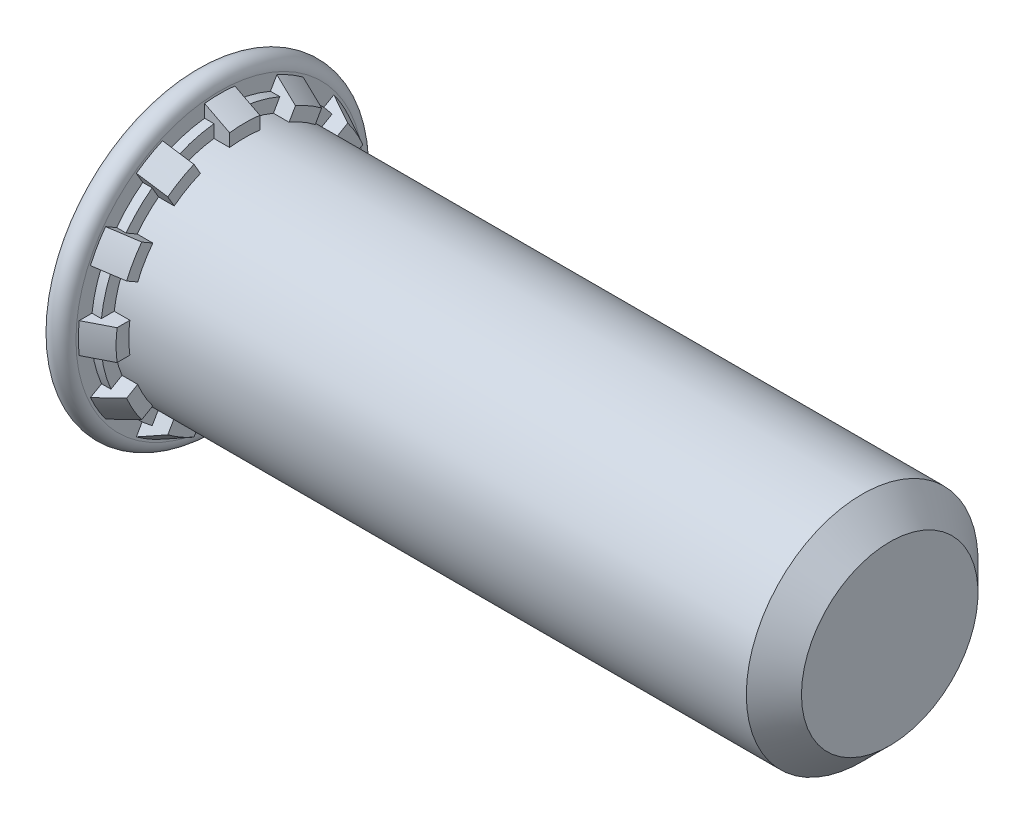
from build123d import *

# Parameters (mm, degrees)
RIBCUT1_DEPTH    = 0.428625
RIBCUT2_DEPTH    = 0.6858
RIBCUTSPAT_COUNT = 12
RIBCUTSPAT_ANGLE = 330


with BuildPart() as part:
    # BodySke → BaseBody (revolve)
    with BuildSketch(Plane.XY, mode=Mode.PRIVATE) as basebody_sk:
        with BuildLine():
            Line((0, 0), (0, 3.93446))
            Line((0, 3.93446), (0.00508, 3.93446))
            Line((0.00508, 3.93446), (0.00508, 3.93954))
            ThreePointArc((0.00508, 3.93954), (0.34544, 4.2799), (0.6858, 3.93954))
            Line((0.6858, 3.93954), (0.6858, 3.8735))
            Line((0.6858, 3.8735), (1.3716, 3.52425))
            Line((1.3716, 3.52425), (1.3716, 3.175))
            Line((1.3716, 3.175), (18.29435, 3.175))
            Line((18.29435, 3.175), (19.05, 2.41935))
            Line((19.05, 2.41935), (19.05, 0))
            Line((19.05, 0), (0, 0))
        make_face()
    revolve(basebody_sk.sketch.rotate(Axis((0, 0, 0), (1, 0, 0)), 90), axis=Axis((0, 0, 0), (1, 0, 0)))

    # RibCut1Ske → RibCut1 (cut)
    with BuildSketch(Plane(origin=(1.3716, 0, 0), x_dir=(0, 0, -1), z_dir=(1, 0, 0))):
        with BuildLine():
            Line((0.41442066, 3.147837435), (0.41442066, 4.259788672))
            ThreePointArc((0.41442066, 4.259788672), (1.107719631, 4.134065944), (1.770995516, 3.896295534))
            Line((1.770995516, 3.896295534), (1.215019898, 2.933317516))
            ThreePointArc((1.215019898, 2.933317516), (0.821750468, 3.066814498), (0.41442066, 3.147837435))
        make_face()
    ribcut1 = extrude(amount=-RIBCUT1_DEPTH, mode=Mode.SUBTRACT)

    # RibCut2Ske → RibCut2 (cut)
    with BuildSketch(Plane(origin=(1.3716, 0, 0), x_dir=(0, 0, -1), z_dir=(1, 0, 0))):
        with BuildLine():
            Line((0.41442066, 3.499799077), (0.41442066, 4.259788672))
            ThreePointArc((0.41442066, 4.259788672), (1.107719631, 4.134065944), (1.770995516, 3.896295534))
            Line((1.770995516, 3.896295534), (1.391000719, 3.238125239))
            ThreePointArc((1.391000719, 3.238125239), (0.91214302, 3.404164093), (0.41442066, 3.499799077))
        make_face()
    ribcut2 = extrude(amount=-RIBCUT2_DEPTH, mode=Mode.SUBTRACT)

    # RibCutsPat: RibCut1, RibCut2 ×12 about axis
    ribcutspat_axis = Axis((0, 0, 0), (1, 0, 0))
    add([ribcut1.rotate(ribcutspat_axis, i * RIBCUTSPAT_ANGLE / (RIBCUTSPAT_COUNT - 1)) for i in range(1, RIBCUTSPAT_COUNT)], mode=Mode.SUBTRACT)
    add([ribcut2.rotate(ribcutspat_axis, i * RIBCUTSPAT_ANGLE / (RIBCUTSPAT_COUNT - 1)) for i in range(1, RIBCUTSPAT_COUNT)], mode=Mode.SUBTRACT)


solid = part.part
